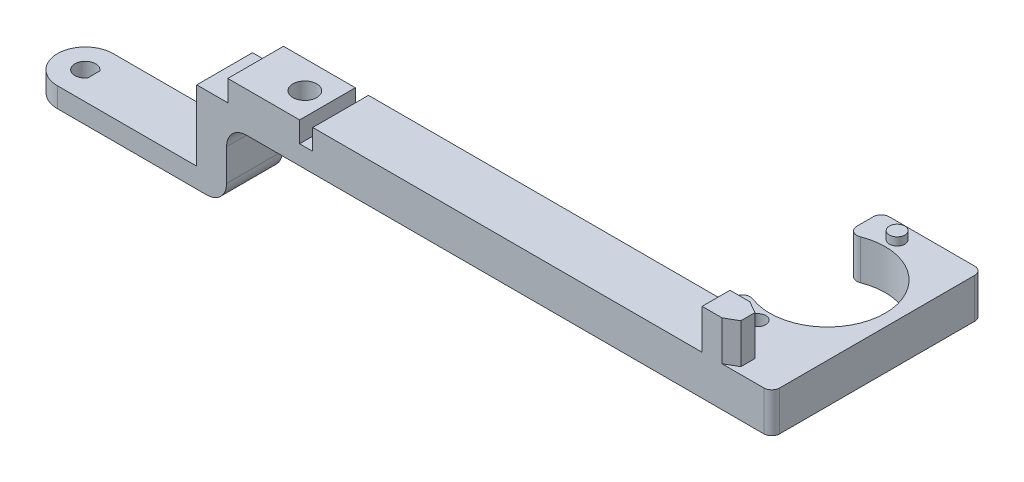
from build123d import *

# Parameters (mm, degrees)
BOSS_EXTRUDE1_DEPTH = 14
SKETCH2_R           = 3
CUT_EXTRUDE1_DEPTH  = 21
CUT_EXTRUDE2_DEPTH  = 8
BOSS_EXTRUDE2_DEPTH = 10
SKETCH7_R           = 1.95
BOSS_EXTRUDE3_DEPTH = 2
SKETCH8_R           = 2
CUT_EXTRUDE3_DEPTH  = 32
FILLET1_R           = 2
FILLET2_R           = 5
BOSS_EXTRUDE5_DEPTH = 10


with BuildPart() as part:
    # Sketch1 → Boss-Extrude1 (new body)
    with BuildSketch(Plane.XY):
        Polygon((49.5, 18), (186.5, 18), (186.5, 28), (71.15, 28), (71.15, 22.8), (67.85, 22.8), (67.85, 28), (49.8, 28), (49.8, 22.7), (42, 22.7), (42, 5), (0, 5), (0, 0), (49.5, 0), align=None)
    extrude(amount=BOSS_EXTRUDE1_DEPTH)

    # Sketch2 → Cut-Extrude1 (cut)
    with BuildSketch(Plane(origin=(0, 28, 0), x_dir=(1, 0, 0), z_dir=(0, 1, 0))):
        with Locations(Location((62.15, -7, 0), (0, 0, 270))):
            Circle(SKETCH2_R)
    extrude(amount=-CUT_EXTRUDE1_DEPTH, mode=Mode.SUBTRACT)

    # Sketch3 → Cut-Extrude2 (cut)
    with BuildSketch(Plane(origin=(0, 5, 0), x_dir=(1, 0, 0), z_dir=(0, 1, 0))):
        with BuildLine():
            Line((0, 0), (0, -7))
            ThreePointArc((0, -7), (2.050252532, -2.050252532), (7, 0))
            Line((7, 0), (0, 0))
        make_face()
        with BuildLine():
            ThreePointArc((7, -14), (2.050252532, -11.949747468), (0, -7))
            Line((0, -7), (0, -14))
            Line((0, -14), (7, -14))
        make_face()
        with BuildLine():
            Line((9, -7), (9, -5.5))
            ThreePointArc((9, -5.5), (6.209430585, -4.628291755), (4.5, -7))
            Line((4.5, -7), (9, -7))
        make_face()
        with BuildLine():
            Line((9, -8.5), (9, -7))
            Line((9, -7), (4.5, -7))
            ThreePointArc((4.5, -7), (6.209430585, -9.371708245), (9, -8.5))
        make_face()
        with BuildLine():
            Line((9, -7), (9, -5.5))
            ThreePointArc((9, -5.5), (6.209430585, -4.628291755), (4.5, -7))
            Line((4.5, -7), (9, -7))
        make_face()
        with BuildLine():
            Line((9, -8.5), (9, -7))
            Line((9, -7), (4.5, -7))
            ThreePointArc((4.5, -7), (6.209430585, -9.371708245), (9, -8.5))
        make_face()
        with BuildLine():
            Line((9.1, -5.467029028), (9.1, -8.532970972))
            ThreePointArc((9.1, -8.532970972), (4.4, -7), (9.1, -5.467029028))
        make_face()
    extrude(amount=-CUT_EXTRUDE2_DEPTH, mode=Mode.SUBTRACT)

    # Sketch6 → Boss-Extrude2 (add)
    with BuildSketch(Plane(origin=(0, 28, 0), x_dir=(1, 0, 0), z_dir=(0, 1, 0))):
        with BuildLine():
            Line((186.5, 17.5), (186.5, 39))
            Line((186.5, 39), (161, 39))
            Line((161, 39), (161, 29.593386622))
            ThreePointArc((161, 29.593386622), (183.5, 17.5), (161, 5.406613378))
            Line((161, 5.406613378), (161, 0))
            Line((161, 0), (186.5, 0))
            Line((186.5, 0), (186.5, 17.5))
        make_face()
    extrude(amount=-BOSS_EXTRUDE2_DEPTH)

    # Sketch7 → Boss-Extrude3 (add)
    with BuildSketch(Plane(origin=(0, 28, 0), x_dir=(1, 0, 0), z_dir=(0, 1, 0))):
        with Locations((169, 35)):
            Circle(SKETCH7_R)
    extrude(amount=BOSS_EXTRUDE3_DEPTH)

    # Sketch8 → Cut-Extrude3 (cut)
    with BuildSketch(Plane(origin=(0, 28, 0), x_dir=(1, 0, 0), z_dir=(0, 1, 0))):
        with Locations(Location((169, 0, 0), (0, 0, 180))):
            Circle(SKETCH8_R)
    extrude(amount=-CUT_EXTRUDE3_DEPTH, mode=Mode.SUBTRACT)

    # Fillet1
    fillet1_edges = [part.edges().sort_by_distance(p)[0] for p in [
        (186.5, 23, 14),
        (186.5, 23, -39),
        (161, 23, 0),
        (161, 23, -5.406613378),
        (161, 23, -29.593386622),
        (161, 23, -39),
    ]]
    fillet(fillet1_edges, radius=FILLET1_R)

    # Fillet2
    fillet2_edges = [part.edges().sort_by_distance(p)[0] for p in [
        (49.5, 18, 7),
        (49.5, 0, 7),
    ]]
    fillet(fillet2_edges, radius=FILLET2_R)

    # Sketch10 → Boss-Extrude5 (add)
    with BuildSketch(Plane(origin=(0, 28, 0), x_dir=(1, 0, 0), z_dir=(0, 1, 0))):
        Polygon((169, -7), (169, -14), (174, -14), (177, -12.267949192), (177, -8.732050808), (174, -7), align=None)
    extrude(amount=BOSS_EXTRUDE5_DEPTH)


solid = part.part
